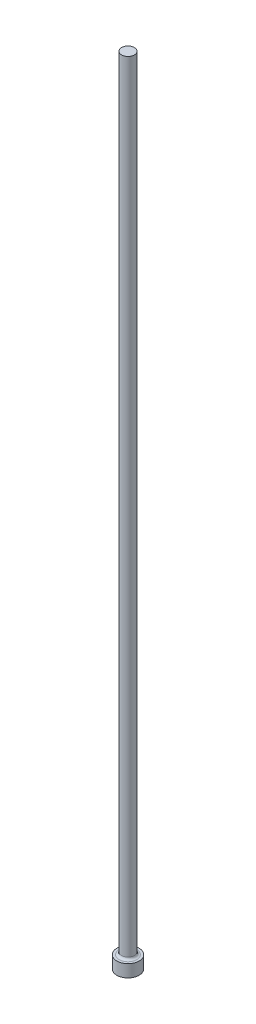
ISO-10303-21;
HEADER;
FILE_DESCRIPTION(('STEP AP214'),'2;1');
FILE_NAME('part.step','',(''),(''),'','','');
FILE_SCHEMA(('AUTOMOTIVE_DESIGN { 1 0 10303 214 1 1 1 1 }'));
ENDSEC;
DATA;
#1=APPLICATION_CONTEXT('core data for automotive mechanical design processes');
#2=APPLICATION_PROTOCOL_DEFINITION('international standard','automotive_design',2000,#1);
#3=PRODUCT_CONTEXT('',#1,'mechanical');
#4=PRODUCT('Part','Part','',(#3));
#5=PRODUCT_RELATED_PRODUCT_CATEGORY('part','',(#4));
#6=PRODUCT_DEFINITION_FORMATION('','',#4);
#7=PRODUCT_DEFINITION_CONTEXT('part definition',#1,'design');
#8=PRODUCT_DEFINITION('design','',#6,#7);
#9=PRODUCT_DEFINITION_SHAPE('','',#8);
#10=(LENGTH_UNIT() NAMED_UNIT(*) SI_UNIT(.MILLI.,.METRE.));
#11=(NAMED_UNIT(*) PLANE_ANGLE_UNIT() SI_UNIT($,.RADIAN.));
#12=(NAMED_UNIT(*) SI_UNIT($,.STERADIAN.) SOLID_ANGLE_UNIT());
#13=UNCERTAINTY_MEASURE_WITH_UNIT(LENGTH_MEASURE(1.E-05),#10,'distance_accuracy_value','');
#14=(GEOMETRIC_REPRESENTATION_CONTEXT(3) GLOBAL_UNCERTAINTY_ASSIGNED_CONTEXT((#13)) GLOBAL_UNIT_ASSIGNED_CONTEXT((#10,
#11,#12)) REPRESENTATION_CONTEXT('',''));
#15=CARTESIAN_POINT('',(0.,0.,0.));
#16=DIRECTION('',(0.,0.,1.));
#17=DIRECTION('',(1.,0.,0.));
#18=AXIS2_PLACEMENT_3D('',#15,#16,#17);
#19=CARTESIAN_POINT('',(2.04724,254.,0.));
#20=DIRECTION('',(0.,-1.,0.));
#21=DIRECTION('',(1.,0.,0.));
#22=AXIS2_PLACEMENT_3D('',#19,#20,#21);
#23=PLANE('',#22);
#24=CARTESIAN_POINT('',(0.,254.,0.));
#25=DIRECTION('',(0.,1.,0.));
#26=DIRECTION('',(-1.,0.,0.));
#27=AXIS2_PLACEMENT_3D('',#24,#25,#26);
#28=CIRCLE('',#27,2.04724000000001);
#29=CARTESIAN_POINT('',(-2.04724000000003,254.,0.));
#30=VERTEX_POINT('',#29);
#31=EDGE_CURVE('E10',#30,#30,#28,.T.);
#32=ORIENTED_EDGE('',*,*,#31,.T.);
#33=EDGE_LOOP('',(#32));
#34=FACE_BOUND('',#33,.T.);
#35=ADVANCED_FACE('F30',(#34),#23,.F.);
#36=CARTESIAN_POINT('',(0.,254.,0.));
#37=DIRECTION('',(0.,1.,0.));
#38=DIRECTION('',(-1.,0.,0.));
#39=AXIS2_PLACEMENT_3D('',#36,#37,#38);
#40=CYLINDRICAL_SURFACE('',#39,2.04724000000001);
#41=ORIENTED_EDGE('',*,*,#31,.F.);
#42=EDGE_LOOP('',(#41));
#43=FACE_BOUND('',#42,.T.);
#44=CARTESIAN_POINT('',(0.,4.72439999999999,0.));
#45=DIRECTION('',(0.,1.,0.));
#46=DIRECTION('',(-1.,0.,0.));
#47=AXIS2_PLACEMENT_3D('',#44,#45,#46);
#48=CIRCLE('',#47,2.04724);
#49=CARTESIAN_POINT('',(-2.04724,4.72439999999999,0.));
#50=VERTEX_POINT('',#49);
#51=EDGE_CURVE('E36',#50,#50,#48,.T.);
#52=ORIENTED_EDGE('',*,*,#51,.T.);
#53=EDGE_LOOP('',(#52));
#54=FACE_BOUND('',#53,.T.);
#55=ADVANCED_FACE('F65',(#43,#54),#40,.T.);
#56=CARTESIAN_POINT('',(0.,4.7244,0.));
#57=DIRECTION('',(0.,1.,0.));
#58=DIRECTION('',(-1.,0.,0.));
#59=AXIS2_PLACEMENT_3D('',#56,#57,#58);
#60=TOROIDAL_SURFACE('',#59,2.80924,0.762);
#61=ORIENTED_EDGE('',*,*,#51,.F.);
#62=EDGE_LOOP('',(#61));
#63=FACE_BOUND('',#62,.T.);
#64=CARTESIAN_POINT('',(0.,3.96239999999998,0.));
#65=DIRECTION('',(0.,1.,0.));
#66=DIRECTION('',(-1.,0.,0.));
#67=AXIS2_PLACEMENT_3D('',#64,#65,#66);
#68=CIRCLE('',#67,2.80924);
#69=CARTESIAN_POINT('',(-2.80924,3.96239999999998,0.));
#70=VERTEX_POINT('',#69);
#71=EDGE_CURVE('E40',#70,#70,#68,.T.);
#72=ORIENTED_EDGE('',*,*,#71,.T.);
#73=EDGE_LOOP('',(#72));
#74=FACE_BOUND('',#73,.T.);
#75=ADVANCED_FACE('F69',(#63,#74),#60,.F.);
#76=CARTESIAN_POINT('',(3.556,3.9624,0.));
#77=DIRECTION('',(0.,-1.,0.));
#78=DIRECTION('',(1.,0.,0.));
#79=AXIS2_PLACEMENT_3D('',#76,#77,#78);
#80=PLANE('',#79);
#81=ORIENTED_EDGE('',*,*,#71,.F.);
#82=EDGE_LOOP('',(#81));
#83=FACE_BOUND('',#82,.T.);
#84=CARTESIAN_POINT('',(0.,3.96239999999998,0.));
#85=DIRECTION('',(0.,1.,0.));
#86=DIRECTION('',(-1.,0.,0.));
#87=AXIS2_PLACEMENT_3D('',#84,#85,#86);
#88=CIRCLE('',#87,3.556);
#89=CARTESIAN_POINT('',(-3.556,3.96239999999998,0.));
#90=VERTEX_POINT('',#89);
#91=EDGE_CURVE('E44',#90,#90,#88,.T.);
#92=ORIENTED_EDGE('',*,*,#91,.T.);
#93=EDGE_LOOP('',(#92));
#94=FACE_BOUND('',#93,.T.);
#95=ADVANCED_FACE('F61',(#83,#94),#80,.F.);
#96=CARTESIAN_POINT('',(0.,254.,0.));
#97=DIRECTION('',(0.,1.,0.));
#98=DIRECTION('',(-1.,0.,0.));
#99=AXIS2_PLACEMENT_3D('',#96,#97,#98);
#100=CYLINDRICAL_SURFACE('',#99,3.556);
#101=ORIENTED_EDGE('',*,*,#91,.F.);
#102=EDGE_LOOP('',(#101));
#103=FACE_BOUND('',#102,.T.);
#104=CARTESIAN_POINT('',(0.,0.,0.));
#105=DIRECTION('',(0.,1.,0.));
#106=DIRECTION('',(-1.,0.,0.));
#107=AXIS2_PLACEMENT_3D('',#104,#105,#106);
#108=CIRCLE('',#107,3.556);
#109=CARTESIAN_POINT('',(-3.556,0.,0.));
#110=VERTEX_POINT('',#109);
#111=EDGE_CURVE('E49',#110,#110,#108,.T.);
#112=ORIENTED_EDGE('',*,*,#111,.T.);
#113=EDGE_LOOP('',(#112));
#114=FACE_BOUND('',#113,.T.);
#115=ADVANCED_FACE('F53',(#103,#114),#100,.T.);
#116=CARTESIAN_POINT('',(0.,0.,0.));
#117=DIRECTION('',(0.,1.,0.));
#118=DIRECTION('',(-1.,0.,0.));
#119=AXIS2_PLACEMENT_3D('',#116,#117,#118);
#120=PLANE('',#119);
#121=ORIENTED_EDGE('',*,*,#111,.F.);
#122=EDGE_LOOP('',(#121));
#123=FACE_BOUND('',#122,.T.);
#124=ADVANCED_FACE('F55',(#123),#120,.F.);
#125=CLOSED_SHELL('',(#35,#55,#75,#95,#115,#124));
#126=MANIFOLD_SOLID_BREP('B2',#125);
#127=ADVANCED_BREP_SHAPE_REPRESENTATION('',(#18,#126),#14);
#128=SHAPE_DEFINITION_REPRESENTATION(#9,#127);
ENDSEC;
END-ISO-10303-21;
